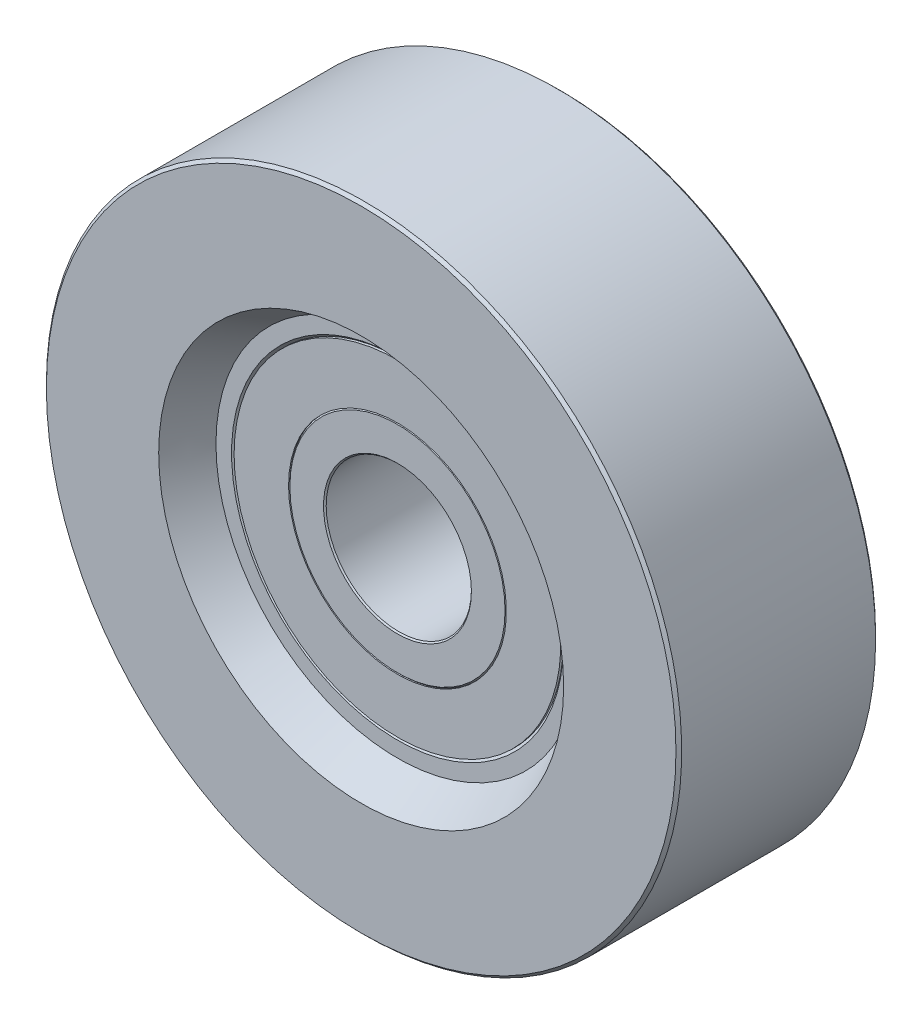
ISO-10303-21;
HEADER;
FILE_DESCRIPTION(('STEP AP214'),'2;1');
FILE_NAME('part.step','',(''),(''),'','','');
FILE_SCHEMA(('AUTOMOTIVE_DESIGN { 1 0 10303 214 1 1 1 1 }'));
ENDSEC;
DATA;
#1=APPLICATION_CONTEXT('core data for automotive mechanical design processes');
#2=APPLICATION_PROTOCOL_DEFINITION('international standard','automotive_design',2000,#1);
#3=PRODUCT_CONTEXT('',#1,'mechanical');
#4=PRODUCT('Part','Part','',(#3));
#5=PRODUCT_RELATED_PRODUCT_CATEGORY('part','',(#4));
#6=PRODUCT_DEFINITION_FORMATION('','',#4);
#7=PRODUCT_DEFINITION_CONTEXT('part definition',#1,'design');
#8=PRODUCT_DEFINITION('design','',#6,#7);
#9=PRODUCT_DEFINITION_SHAPE('','',#8);
#10=(LENGTH_UNIT() NAMED_UNIT(*) SI_UNIT(.MILLI.,.METRE.));
#11=(NAMED_UNIT(*) PLANE_ANGLE_UNIT() SI_UNIT($,.RADIAN.));
#12=(NAMED_UNIT(*) SI_UNIT($,.STERADIAN.) SOLID_ANGLE_UNIT());
#13=UNCERTAINTY_MEASURE_WITH_UNIT(LENGTH_MEASURE(1.E-05),#10,'distance_accuracy_value','');
#14=(GEOMETRIC_REPRESENTATION_CONTEXT(3) GLOBAL_UNCERTAINTY_ASSIGNED_CONTEXT((#13)) GLOBAL_UNIT_ASSIGNED_CONTEXT((#10,
#11,#12)) REPRESENTATION_CONTEXT('',''));
#15=CARTESIAN_POINT('',(0.,0.,0.));
#16=DIRECTION('',(0.,0.,1.));
#17=DIRECTION('',(1.,0.,0.));
#18=AXIS2_PLACEMENT_3D('',#15,#16,#17);
#19=CARTESIAN_POINT('',(0.,0.,-3.15));
#20=DIRECTION('',(0.,0.,-1.));
#21=DIRECTION('',(-1.,0.,0.));
#22=AXIS2_PLACEMENT_3D('',#19,#20,#21);
#23=CYLINDRICAL_SURFACE('',#22,6.);
#24=CARTESIAN_POINT('',(0.,0.,-3.5));
#25=DIRECTION('',(0.,0.,-1.));
#26=DIRECTION('',(-1.,0.,0.));
#27=AXIS2_PLACEMENT_3D('',#24,#25,#26);
#28=CIRCLE('',#27,6.);
#29=CARTESIAN_POINT('',(-6.,0.,-3.5));
#30=VERTEX_POINT('',#29);
#31=EDGE_CURVE('E344',#30,#30,#28,.F.);
#32=ORIENTED_EDGE('',*,*,#31,.F.);
#33=EDGE_LOOP('',(#32));
#34=FACE_BOUND('',#33,.T.);
#35=CARTESIAN_POINT('',(0.,0.,-3.42638036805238));
#36=DIRECTION('',(0.,0.,1.));
#37=DIRECTION('',(0.,1.,0.));
#38=AXIS2_PLACEMENT_3D('',#35,#36,#37);
#39=CIRCLE('',#38,5.99999999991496);
#40=CARTESIAN_POINT('',(0.,5.99999999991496,-3.42638036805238));
#41=VERTEX_POINT('',#40);
#42=EDGE_CURVE('E8',#41,#41,#39,.F.);
#43=ORIENTED_EDGE('',*,*,#42,.F.);
#44=EDGE_LOOP('',(#43));
#45=FACE_BOUND('',#44,.T.);
#46=ADVANCED_FACE('F12',(#34,#45),#23,.F.);
#47=CARTESIAN_POINT('',(0.,0.,-3.15));
#48=DIRECTION('',(0.,0.,-1.));
#49=DIRECTION('',(-1.,0.,0.));
#50=AXIS2_PLACEMENT_3D('',#47,#48,#49);
#51=CYLINDRICAL_SURFACE('',#50,9.);
#52=CARTESIAN_POINT('',(0.,0.,-3.36));
#53=DIRECTION('',(0.,0.,-1.));
#54=DIRECTION('',(0.,1.,0.));
#55=AXIS2_PLACEMENT_3D('',#52,#53,#54);
#56=CIRCLE('',#55,9.);
#57=CARTESIAN_POINT('',(0.,9.,-3.36));
#58=VERTEX_POINT('',#57);
#59=EDGE_CURVE('E20',#58,#58,#56,.T.);
#60=ORIENTED_EDGE('',*,*,#59,.T.);
#61=EDGE_LOOP('',(#60));
#62=FACE_BOUND('',#61,.T.);
#63=CARTESIAN_POINT('',(0.,0.,-3.5));
#64=DIRECTION('',(0.,0.,-1.));
#65=DIRECTION('',(-1.,0.,0.));
#66=AXIS2_PLACEMENT_3D('',#63,#64,#65);
#67=CIRCLE('',#66,9.);
#68=CARTESIAN_POINT('',(-9.,0.,-3.5));
#69=VERTEX_POINT('',#68);
#70=EDGE_CURVE('E25',#69,#69,#67,.F.);
#71=ORIENTED_EDGE('',*,*,#70,.T.);
#72=EDGE_LOOP('',(#71));
#73=FACE_BOUND('',#72,.T.);
#74=ADVANCED_FACE('F111',(#62,#73),#51,.T.);
#75=CARTESIAN_POINT('',(0.,7.5,-3.5));
#76=DIRECTION('',(0.,0.,-1.));
#77=DIRECTION('',(-1.,0.,0.));
#78=AXIS2_PLACEMENT_3D('',#75,#76,#77);
#79=PLANE('',#78);
#80=ORIENTED_EDGE('',*,*,#31,.T.);
#81=EDGE_LOOP('',(#80));
#82=FACE_BOUND('',#81,.T.);
#83=ORIENTED_EDGE('',*,*,#70,.F.);
#84=EDGE_LOOP('',(#83));
#85=FACE_BOUND('',#84,.T.);
#86=ADVANCED_FACE('F118',(#82,#85),#79,.T.);
#87=CARTESIAN_POINT('',(0.,0.,3.5));
#88=DIRECTION('',(0.,0.,1.));
#89=DIRECTION('',(1.,0.,0.));
#90=AXIS2_PLACEMENT_3D('',#87,#88,#89);
#91=CONICAL_SURFACE('',#90,9.14,0.785398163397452);
#92=CARTESIAN_POINT('',(0.,0.,3.36));
#93=DIRECTION('',(0.,0.,1.));
#94=DIRECTION('',(0.,1.,0.));
#95=AXIS2_PLACEMENT_3D('',#92,#93,#94);
#96=CIRCLE('',#95,9.);
#97=CARTESIAN_POINT('',(0.,9.,3.36));
#98=VERTEX_POINT('',#97);
#99=EDGE_CURVE('E54',#98,#98,#96,.T.);
#100=ORIENTED_EDGE('',*,*,#99,.F.);
#101=EDGE_LOOP('',(#100));
#102=FACE_BOUND('',#101,.T.);
#103=CARTESIAN_POINT('',(0.,0.,3.5));
#104=DIRECTION('',(0.,0.,1.));
#105=DIRECTION('',(1.,0.,0.));
#106=AXIS2_PLACEMENT_3D('',#103,#104,#105);
#107=CIRCLE('',#106,9.14);
#108=CARTESIAN_POINT('',(9.14,0.,3.5));
#109=VERTEX_POINT('',#108);
#110=EDGE_CURVE('E57',#109,#109,#107,.F.);
#111=ORIENTED_EDGE('',*,*,#110,.F.);
#112=EDGE_LOOP('',(#111));
#113=FACE_BOUND('',#112,.T.);
#114=ADVANCED_FACE('F126',(#102,#113),#91,.F.);
#115=CARTESIAN_POINT('',(0.,9.57,3.5));
#116=DIRECTION('',(0.,0.,1.));
#117=DIRECTION('',(0.,-1.,0.));
#118=AXIS2_PLACEMENT_3D('',#115,#116,#117);
#119=PLANE('',#118);
#120=CARTESIAN_POINT('',(0.,0.,3.5));
#121=DIRECTION('',(0.,0.,1.));
#122=DIRECTION('',(1.,0.,0.));
#123=AXIS2_PLACEMENT_3D('',#120,#121,#122);
#124=CIRCLE('',#123,10.);
#125=CARTESIAN_POINT('',(10.,0.,3.5));
#126=VERTEX_POINT('',#125);
#127=EDGE_CURVE('E73',#126,#126,#124,.T.);
#128=ORIENTED_EDGE('',*,*,#127,.T.);
#129=EDGE_LOOP('',(#128));
#130=FACE_BOUND('',#129,.T.);
#131=ORIENTED_EDGE('',*,*,#110,.T.);
#132=EDGE_LOOP('',(#131));
#133=FACE_BOUND('',#132,.T.);
#134=ADVANCED_FACE('F172',(#130,#133),#119,.T.);
#135=CARTESIAN_POINT('',(0.,0.,5.5));
#136=DIRECTION('',(0.,0.,1.));
#137=DIRECTION('',(1.,0.,0.));
#138=AXIS2_PLACEMENT_3D('',#135,#136,#137);
#139=CONICAL_SURFACE('',#138,11.1547005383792,0.523598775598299);
#140=ORIENTED_EDGE('',*,*,#127,.F.);
#141=EDGE_LOOP('',(#140));
#142=FACE_BOUND('',#141,.T.);
#143=CARTESIAN_POINT('',(0.,0.,5.5));
#144=DIRECTION('',(0.,0.,1.));
#145=DIRECTION('',(1.,0.,0.));
#146=AXIS2_PLACEMENT_3D('',#143,#144,#145);
#147=CIRCLE('',#146,11.1547005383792);
#148=CARTESIAN_POINT('',(11.1547005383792,0.,5.5));
#149=VERTEX_POINT('',#148);
#150=EDGE_CURVE('E67',#149,#149,#147,.F.);
#151=ORIENTED_EDGE('',*,*,#150,.F.);
#152=EDGE_LOOP('',(#151));
#153=FACE_BOUND('',#152,.T.);
#154=ADVANCED_FACE('F163',(#142,#153),#139,.F.);
#155=CARTESIAN_POINT('',(0.,14.2485214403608,5.5));
#156=DIRECTION('',(0.,0.,1.));
#157=DIRECTION('',(1.,0.,0.));
#158=AXIS2_PLACEMENT_3D('',#155,#156,#157);
#159=PLANE('',#158);
#160=CARTESIAN_POINT('',(0.,0.,5.5));
#161=DIRECTION('',(0.,0.,-1.));
#162=DIRECTION('',(-1.,0.,0.));
#163=AXIS2_PLACEMENT_3D('',#160,#161,#162);
#164=CIRCLE('',#163,17.3423423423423);
#165=CARTESIAN_POINT('',(-17.3423423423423,0.,5.5));
#166=VERTEX_POINT('',#165);
#167=EDGE_CURVE('E61',#166,#166,#164,.T.);
#168=ORIENTED_EDGE('',*,*,#167,.F.);
#169=EDGE_LOOP('',(#168));
#170=FACE_BOUND('',#169,.T.);
#171=ORIENTED_EDGE('',*,*,#150,.T.);
#172=EDGE_LOOP('',(#171));
#173=FACE_BOUND('',#172,.T.);
#174=ADVANCED_FACE('F158',(#170,#173),#159,.T.);
#175=CARTESIAN_POINT('',(0.,0.,5.34234234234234));
#176=DIRECTION('',(0.,0.,-1.));
#177=DIRECTION('',(-1.,0.,0.));
#178=AXIS2_PLACEMENT_3D('',#175,#176,#177);
#179=CONICAL_SURFACE('',#178,17.5,0.78539816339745);
#180=ORIENTED_EDGE('',*,*,#167,.T.);
#181=EDGE_LOOP('',(#180));
#182=FACE_BOUND('',#181,.T.);
#183=CARTESIAN_POINT('',(0.,0.,5.34234234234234));
#184=DIRECTION('',(0.,0.,-1.));
#185=DIRECTION('',(-1.,0.,0.));
#186=AXIS2_PLACEMENT_3D('',#183,#184,#185);
#187=CIRCLE('',#186,17.5);
#188=CARTESIAN_POINT('',(-17.5,0.,5.34234234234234));
#189=VERTEX_POINT('',#188);
#190=EDGE_CURVE('E48',#189,#189,#187,.T.);
#191=ORIENTED_EDGE('',*,*,#190,.F.);
#192=EDGE_LOOP('',(#191));
#193=FACE_BOUND('',#192,.T.);
#194=ADVANCED_FACE('F152',(#182,#193),#179,.T.);
#195=CARTESIAN_POINT('',(0.,0.,0.));
#196=DIRECTION('',(0.,0.,-1.));
#197=DIRECTION('',(-1.,0.,0.));
#198=AXIS2_PLACEMENT_3D('',#195,#196,#197);
#199=CYLINDRICAL_SURFACE('',#198,17.5);
#200=ORIENTED_EDGE('',*,*,#190,.T.);
#201=EDGE_LOOP('',(#200));
#202=FACE_BOUND('',#201,.T.);
#203=CARTESIAN_POINT('',(0.,0.,-5.3423423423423));
#204=DIRECTION('',(0.,0.,-1.));
#205=DIRECTION('',(-1.,0.,0.));
#206=AXIS2_PLACEMENT_3D('',#203,#204,#205);
#207=CIRCLE('',#206,17.5);
#208=CARTESIAN_POINT('',(-17.5,0.,-5.3423423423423));
#209=VERTEX_POINT('',#208);
#210=EDGE_CURVE('E35',#209,#209,#207,.F.);
#211=ORIENTED_EDGE('',*,*,#210,.T.);
#212=EDGE_LOOP('',(#211));
#213=FACE_BOUND('',#212,.T.);
#214=ADVANCED_FACE('F149',(#202,#213),#199,.T.);
#215=CARTESIAN_POINT('',(0.,0.,-5.34234234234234));
#216=DIRECTION('',(0.,0.,1.));
#217=DIRECTION('',(1.,0.,0.));
#218=AXIS2_PLACEMENT_3D('',#215,#216,#217);
#219=CONICAL_SURFACE('',#218,17.5,0.785398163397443);
#220=CARTESIAN_POINT('',(0.,0.,-5.5));
#221=DIRECTION('',(0.,0.,1.));
#222=DIRECTION('',(1.,0.,0.));
#223=AXIS2_PLACEMENT_3D('',#220,#221,#222);
#224=CIRCLE('',#223,17.3423423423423);
#225=CARTESIAN_POINT('',(17.3423423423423,0.,-5.5));
#226=VERTEX_POINT('',#225);
#227=EDGE_CURVE('E51',#226,#226,#224,.T.);
#228=ORIENTED_EDGE('',*,*,#227,.T.);
#229=EDGE_LOOP('',(#228));
#230=FACE_BOUND('',#229,.T.);
#231=ORIENTED_EDGE('',*,*,#210,.F.);
#232=EDGE_LOOP('',(#231));
#233=FACE_BOUND('',#232,.T.);
#234=ADVANCED_FACE('F107',(#230,#233),#219,.T.);
#235=CARTESIAN_POINT('',(0.,14.2485214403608,-5.5));
#236=DIRECTION('',(0.,0.,-1.));
#237=DIRECTION('',(-1.,0.,0.));
#238=AXIS2_PLACEMENT_3D('',#235,#236,#237);
#239=PLANE('',#238);
#240=CARTESIAN_POINT('',(0.,0.,-5.5));
#241=DIRECTION('',(0.,0.,-1.));
#242=DIRECTION('',(-1.,0.,0.));
#243=AXIS2_PLACEMENT_3D('',#240,#241,#242);
#244=CIRCLE('',#243,11.1547005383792);
#245=CARTESIAN_POINT('',(-11.1547005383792,0.,-5.5));
#246=VERTEX_POINT('',#245);
#247=EDGE_CURVE('E64',#246,#246,#244,.F.);
#248=ORIENTED_EDGE('',*,*,#247,.T.);
#249=EDGE_LOOP('',(#248));
#250=FACE_BOUND('',#249,.T.);
#251=ORIENTED_EDGE('',*,*,#227,.F.);
#252=EDGE_LOOP('',(#251));
#253=FACE_BOUND('',#252,.T.);
#254=ADVANCED_FACE('F91',(#250,#253),#239,.T.);
#255=CARTESIAN_POINT('',(0.,0.,-5.5));
#256=DIRECTION('',(0.,0.,-1.));
#257=DIRECTION('',(-1.,0.,0.));
#258=AXIS2_PLACEMENT_3D('',#255,#256,#257);
#259=CONICAL_SURFACE('',#258,11.1547005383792,0.523598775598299);
#260=ORIENTED_EDGE('',*,*,#247,.F.);
#261=EDGE_LOOP('',(#260));
#262=FACE_BOUND('',#261,.T.);
#263=CARTESIAN_POINT('',(0.,0.,-3.5));
#264=DIRECTION('',(0.,0.,-1.));
#265=DIRECTION('',(-1.,0.,0.));
#266=AXIS2_PLACEMENT_3D('',#263,#264,#265);
#267=CIRCLE('',#266,10.);
#268=CARTESIAN_POINT('',(-10.,0.,-3.5));
#269=VERTEX_POINT('',#268);
#270=EDGE_CURVE('E70',#269,#269,#267,.T.);
#271=ORIENTED_EDGE('',*,*,#270,.F.);
#272=EDGE_LOOP('',(#271));
#273=FACE_BOUND('',#272,.T.);
#274=ADVANCED_FACE('F106',(#262,#273),#259,.F.);
#275=CARTESIAN_POINT('',(0.,0.,-3.5));
#276=DIRECTION('',(0.,0.,-1.));
#277=DIRECTION('',(-1.,0.,0.));
#278=AXIS2_PLACEMENT_3D('',#275,#276,#277);
#279=CONICAL_SURFACE('',#278,9.14,0.785398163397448);
#280=CARTESIAN_POINT('',(0.,0.,-3.5));
#281=DIRECTION('',(0.,0.,-1.));
#282=DIRECTION('',(-1.,0.,0.));
#283=AXIS2_PLACEMENT_3D('',#280,#281,#282);
#284=CIRCLE('',#283,9.14);
#285=CARTESIAN_POINT('',(-9.14,0.,-3.5));
#286=VERTEX_POINT('',#285);
#287=EDGE_CURVE('E76',#286,#286,#284,.F.);
#288=ORIENTED_EDGE('',*,*,#287,.F.);
#289=EDGE_LOOP('',(#288));
#290=FACE_BOUND('',#289,.T.);
#291=ORIENTED_EDGE('',*,*,#59,.F.);
#292=EDGE_LOOP('',(#291));
#293=FACE_BOUND('',#292,.T.);
#294=ADVANCED_FACE('F167',(#290,#293),#279,.F.);
#295=CARTESIAN_POINT('',(0.,9.57,-3.5));
#296=DIRECTION('',(0.,0.,-1.));
#297=DIRECTION('',(-1.,0.,0.));
#298=AXIS2_PLACEMENT_3D('',#295,#296,#297);
#299=PLANE('',#298);
#300=ORIENTED_EDGE('',*,*,#287,.T.);
#301=EDGE_LOOP('',(#300));
#302=FACE_BOUND('',#301,.T.);
#303=ORIENTED_EDGE('',*,*,#270,.T.);
#304=EDGE_LOOP('',(#303));
#305=FACE_BOUND('',#304,.T.);
#306=ADVANCED_FACE('F169',(#302,#305),#299,.T.);
#307=CARTESIAN_POINT('',(0.,0.,3.15));
#308=DIRECTION('',(0.,0.,-1.));
#309=DIRECTION('',(-1.,0.,0.));
#310=AXIS2_PLACEMENT_3D('',#307,#308,#309);
#311=CYLINDRICAL_SURFACE('',#310,9.);
#312=CARTESIAN_POINT('',(0.,0.,3.5));
#313=DIRECTION('',(0.,0.,-1.));
#314=DIRECTION('',(-1.,0.,0.));
#315=AXIS2_PLACEMENT_3D('',#312,#313,#314);
#316=CIRCLE('',#315,9.);
#317=CARTESIAN_POINT('',(-9.,0.,3.5));
#318=VERTEX_POINT('',#317);
#319=EDGE_CURVE('E58',#318,#318,#316,.F.);
#320=ORIENTED_EDGE('',*,*,#319,.F.);
#321=EDGE_LOOP('',(#320));
#322=FACE_BOUND('',#321,.T.);
#323=ORIENTED_EDGE('',*,*,#99,.T.);
#324=EDGE_LOOP('',(#323));
#325=FACE_BOUND('',#324,.T.);
#326=ADVANCED_FACE('F102',(#322,#325),#311,.T.);
#327=CARTESIAN_POINT('',(0.,7.5,3.5));
#328=DIRECTION('',(0.,0.,1.));
#329=DIRECTION('',(1.,0.,0.));
#330=AXIS2_PLACEMENT_3D('',#327,#328,#329);
#331=PLANE('',#330);
#332=ORIENTED_EDGE('',*,*,#319,.T.);
#333=EDGE_LOOP('',(#332));
#334=FACE_BOUND('',#333,.T.);
#335=CARTESIAN_POINT('',(0.,0.,3.5));
#336=DIRECTION('',(0.,0.,-1.));
#337=DIRECTION('',(-1.,0.,0.));
#338=AXIS2_PLACEMENT_3D('',#335,#336,#337);
#339=CIRCLE('',#338,6.);
#340=CARTESIAN_POINT('',(-6.,0.,3.5));
#341=VERTEX_POINT('',#340);
#342=EDGE_CURVE('E16',#341,#341,#339,.T.);
#343=ORIENTED_EDGE('',*,*,#342,.T.);
#344=EDGE_LOOP('',(#343));
#345=FACE_BOUND('',#344,.T.);
#346=ADVANCED_FACE('F86',(#334,#345),#331,.T.);
#347=CARTESIAN_POINT('',(0.,0.,3.15));
#348=DIRECTION('',(0.,0.,-1.));
#349=DIRECTION('',(-1.,0.,0.));
#350=AXIS2_PLACEMENT_3D('',#347,#348,#349);
#351=CYLINDRICAL_SURFACE('',#350,6.);
#352=CARTESIAN_POINT('',(0.,0.,3.42638036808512));
#353=DIRECTION('',(0.,0.,-1.));
#354=DIRECTION('',(0.,1.,0.));
#355=AXIS2_PLACEMENT_3D('',#352,#353,#354);
#356=CIRCLE('',#355,6.00000000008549);
#357=CARTESIAN_POINT('',(0.,6.00000000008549,3.42638036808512));
#358=VERTEX_POINT('',#357);
#359=EDGE_CURVE('E31',#358,#358,#356,.F.);
#360=ORIENTED_EDGE('',*,*,#359,.F.);
#361=EDGE_LOOP('',(#360));
#362=FACE_BOUND('',#361,.T.);
#363=ORIENTED_EDGE('',*,*,#342,.F.);
#364=EDGE_LOOP('',(#363));
#365=FACE_BOUND('',#364,.T.);
#366=ADVANCED_FACE('F14',(#362,#365),#351,.F.);
#367=CARTESIAN_POINT('',(0.,0.,3.42638036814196));
#368=DIRECTION('',(0.,0.,-1.));
#369=DIRECTION('',(-1.,0.,0.));
#370=AXIS2_PLACEMENT_3D('',#367,#368,#369);
#371=CONICAL_SURFACE('',#370,5.99999999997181,0.785398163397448);
#372=CARTESIAN_POINT('',(0.,0.,3.49999999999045));
#373=DIRECTION('',(0.,0.,-1.));
#374=DIRECTION('',(-1.,0.,0.));
#375=AXIS2_PLACEMENT_3D('',#372,#373,#374);
#376=CIRCLE('',#375,5.92638036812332);
#377=CARTESIAN_POINT('',(-5.92638036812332,0.,3.49999999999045));
#378=VERTEX_POINT('',#377);
#379=EDGE_CURVE('E34',#378,#378,#376,.F.);
#380=ORIENTED_EDGE('',*,*,#379,.F.);
#381=EDGE_LOOP('',(#380));
#382=FACE_BOUND('',#381,.T.);
#383=ORIENTED_EDGE('',*,*,#359,.T.);
#384=EDGE_LOOP('',(#383));
#385=FACE_BOUND('',#384,.T.);
#386=ADVANCED_FACE('F89',(#382,#385),#371,.T.);
#387=CARTESIAN_POINT('',(0.,5.,3.5));
#388=DIRECTION('',(0.,0.,1.));
#389=DIRECTION('',(1.,0.,0.));
#390=AXIS2_PLACEMENT_3D('',#387,#388,#389);
#391=PLANE('',#390);
#392=ORIENTED_EDGE('',*,*,#379,.T.);
#393=EDGE_LOOP('',(#392));
#394=FACE_BOUND('',#393,.T.);
#395=CARTESIAN_POINT('',(0.,0.,3.50000000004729));
#396=DIRECTION('',(0.,0.,1.));
#397=DIRECTION('',(1.,0.,0.));
#398=AXIS2_PLACEMENT_3D('',#395,#396,#397);
#399=CIRCLE('',#398,4.07361963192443);
#400=CARTESIAN_POINT('',(4.07361963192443,0.,3.50000000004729));
#401=VERTEX_POINT('',#400);
#402=EDGE_CURVE('E40',#401,#401,#399,.F.);
#403=ORIENTED_EDGE('',*,*,#402,.T.);
#404=EDGE_LOOP('',(#403));
#405=FACE_BOUND('',#404,.T.);
#406=ADVANCED_FACE('F98',(#394,#405),#391,.T.);
#407=CARTESIAN_POINT('',(0.,0.,3.49999999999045));
#408=DIRECTION('',(0.,0.,1.));
#409=DIRECTION('',(1.,0.,0.));
#410=AXIS2_PLACEMENT_3D('',#407,#408,#409);
#411=CONICAL_SURFACE('',#410,4.07361963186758,0.785398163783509);
#412=CARTESIAN_POINT('',(0.,0.,3.42638036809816));
#413=DIRECTION('',(0.,0.,-1.));
#414=DIRECTION('',(-1.,0.,0.));
#415=AXIS2_PLACEMENT_3D('',#412,#413,#414);
#416=CIRCLE('',#415,4.);
#417=CARTESIAN_POINT('',(-4.,0.,3.42638036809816));
#418=VERTEX_POINT('',#417);
#419=EDGE_CURVE('E39',#418,#418,#416,.T.);
#420=ORIENTED_EDGE('',*,*,#419,.T.);
#421=EDGE_LOOP('',(#420));
#422=FACE_BOUND('',#421,.T.);
#423=ORIENTED_EDGE('',*,*,#402,.F.);
#424=EDGE_LOOP('',(#423));
#425=FACE_BOUND('',#424,.T.);
#426=ADVANCED_FACE('F133',(#422,#425),#411,.F.);
#427=CARTESIAN_POINT('',(0.,0.,0.));
#428=DIRECTION('',(0.,0.,-1.));
#429=DIRECTION('',(-1.,0.,0.));
#430=AXIS2_PLACEMENT_3D('',#427,#428,#429);
#431=CYLINDRICAL_SURFACE('',#430,4.);
#432=CARTESIAN_POINT('',(0.,0.,-3.42638036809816));
#433=DIRECTION('',(0.,0.,-1.));
#434=DIRECTION('',(-1.,0.,0.));
#435=AXIS2_PLACEMENT_3D('',#432,#433,#434);
#436=CIRCLE('',#435,4.);
#437=CARTESIAN_POINT('',(-4.,0.,-3.42638036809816));
#438=VERTEX_POINT('',#437);
#439=EDGE_CURVE('E29',#438,#438,#436,.F.);
#440=ORIENTED_EDGE('',*,*,#439,.F.);
#441=EDGE_LOOP('',(#440));
#442=FACE_BOUND('',#441,.T.);
#443=ORIENTED_EDGE('',*,*,#419,.F.);
#444=EDGE_LOOP('',(#443));
#445=FACE_BOUND('',#444,.T.);
#446=ADVANCED_FACE('F129',(#442,#445),#431,.F.);
#447=CARTESIAN_POINT('',(0.,0.,-3.50000000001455));
#448=DIRECTION('',(0.,0.,-1.));
#449=DIRECTION('',(-1.,0.,0.));
#450=AXIS2_PLACEMENT_3D('',#447,#448,#449);
#451=CONICAL_SURFACE('',#450,4.07361963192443,0.785398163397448);
#452=CARTESIAN_POINT('',(0.,0.,-3.50000000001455));
#453=DIRECTION('',(0.,0.,-1.));
#454=DIRECTION('',(-1.,0.,0.));
#455=AXIS2_PLACEMENT_3D('',#452,#453,#454);
#456=CIRCLE('',#455,4.07361963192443);
#457=CARTESIAN_POINT('',(-4.07361963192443,0.,-3.50000000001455));
#458=VERTEX_POINT('',#457);
#459=EDGE_CURVE('E36',#458,#458,#456,.F.);
#460=ORIENTED_EDGE('',*,*,#459,.F.);
#461=EDGE_LOOP('',(#460));
#462=FACE_BOUND('',#461,.T.);
#463=ORIENTED_EDGE('',*,*,#439,.T.);
#464=EDGE_LOOP('',(#463));
#465=FACE_BOUND('',#464,.T.);
#466=ADVANCED_FACE('F132',(#462,#465),#451,.F.);
#467=CARTESIAN_POINT('',(0.,5.,-3.5));
#468=DIRECTION('',(0.,0.,-1.));
#469=DIRECTION('',(-1.,0.,0.));
#470=AXIS2_PLACEMENT_3D('',#467,#468,#469);
#471=PLANE('',#470);
#472=ORIENTED_EDGE('',*,*,#459,.T.);
#473=EDGE_LOOP('',(#472));
#474=FACE_BOUND('',#473,.T.);
#475=CARTESIAN_POINT('',(0.,0.,-3.49999999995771));
#476=DIRECTION('',(0.,0.,1.));
#477=DIRECTION('',(1.,0.,0.));
#478=AXIS2_PLACEMENT_3D('',#475,#476,#477);
#479=CIRCLE('',#478,5.92638036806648);
#480=CARTESIAN_POINT('',(5.92638036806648,0.,-3.49999999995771));
#481=VERTEX_POINT('',#480);
#482=EDGE_CURVE('E43',#481,#481,#479,.F.);
#483=ORIENTED_EDGE('',*,*,#482,.T.);
#484=EDGE_LOOP('',(#483));
#485=FACE_BOUND('',#484,.T.);
#486=ADVANCED_FACE('F128',(#474,#485),#471,.T.);
#487=CARTESIAN_POINT('',(0.,0.,-3.42638036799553));
#488=DIRECTION('',(0.,0.,1.));
#489=DIRECTION('',(1.,0.,0.));
#490=AXIS2_PLACEMENT_3D('',#487,#488,#489);
#491=CONICAL_SURFACE('',#490,6.00000000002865,0.785398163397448);
#492=ORIENTED_EDGE('',*,*,#42,.T.);
#493=EDGE_LOOP('',(#492));
#494=FACE_BOUND('',#493,.T.);
#495=ORIENTED_EDGE('',*,*,#482,.F.);
#496=EDGE_LOOP('',(#495));
#497=FACE_BOUND('',#496,.T.);
#498=ADVANCED_FACE('F101',(#494,#497),#491,.T.);
#499=CLOSED_SHELL('',(#46,#74,#86,#114,#134,#154,#174,#194,#214,#234,#254,#274,#294,#306,#326,
#346,#366,#386,#406,#426,#446,#466,#486,#498));
#500=MANIFOLD_SOLID_BREP('B1',#499);
#501=ADVANCED_BREP_SHAPE_REPRESENTATION('',(#18,#500),#14);
#502=SHAPE_DEFINITION_REPRESENTATION(#9,#501);
ENDSEC;
END-ISO-10303-21;
